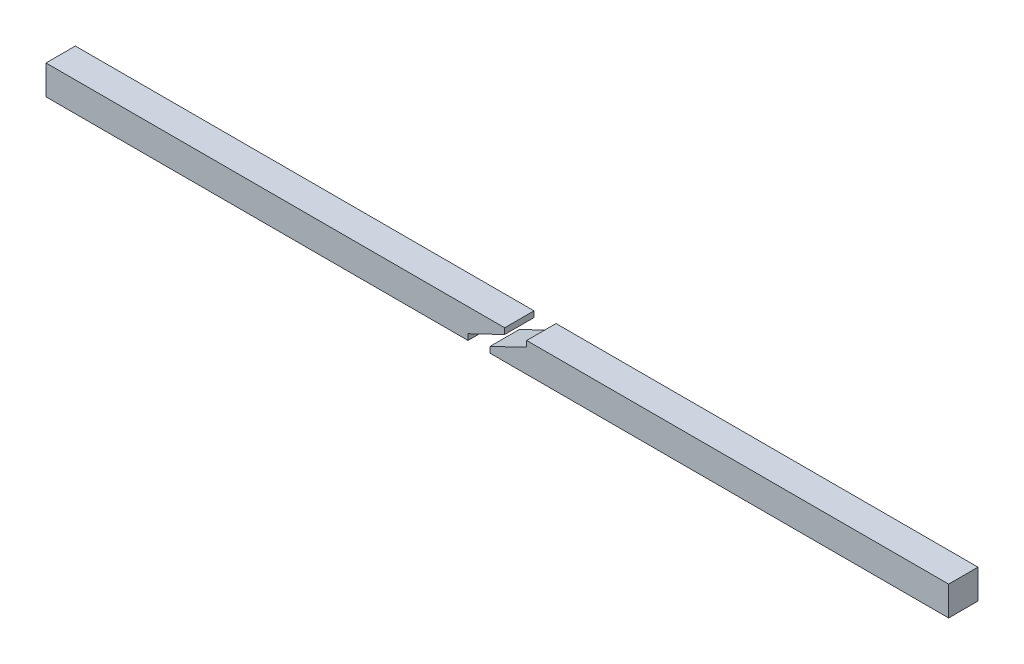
from build123d import *

# Parameters (mm, degrees)
SZKIC11_W                               = 200
SZKIC11_H                               = 200
WI_BA_DACHOWA_MUR_ATA_200_X_200_1_DEPTH = 3125
SZKIC12_W                               = 200
SZKIC12_H                               = 200
WI_BA_DACHOWA_MUR_ATA_200_X_200_2_DEPTH = 3125
WYTNIJ_WYCI_GNI_CIE1_DEPTH              = 3172.784935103
WYTNIJ_WYCI_GNI_CIE2_DEPTH              = 3302.565412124


with BuildPart() as part:
    # Szkic11 → Wi_ba dachowa MUR_ATA 200 X 200_1 (new body)
    with BuildSketch(Plane.YZ):
        Rectangle(SZKIC11_W, SZKIC11_H)
    extrude(amount=WI_BA_DACHOWA_MUR_ATA_200_X_200_1_DEPTH)

    # Szkic2 → Wytnij-wyci_gni_cie1 (cut, through all)
    with BuildSketch(Plane(origin=(2837.132527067, 28.409591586, 100), x_dir=(1, 0, 0), z_dir=(0, 0, 1))):
        Polygon((37.867472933, -128.409591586), (287.867472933, -128.409591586), (287.867472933, 31.590408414), (37.867472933, -88.409591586), align=None)
    extrude(amount=-WYTNIJ_WYCI_GNI_CIE1_DEPTH, mode=Mode.SUBTRACT)


with BuildPart() as body_2:
    # Szkic12 → Wi_ba dachowa MUR_ATA 200 X 200_2 (new body)
    with BuildSketch(Plane.YZ.offset(2875)):
        Rectangle(SZKIC12_W, SZKIC12_H)
    extrude(amount=WI_BA_DACHOWA_MUR_ATA_200_X_200_2_DEPTH)

    # Szkic3 → Wytnij-wyci_gni_cie2 (cut, through all)
    with BuildSketch(Plane(origin=(3293.239734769, -22.091031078, 100), x_dir=(1, 0, 0), z_dir=(0, 0, 1))):
        Polygon((-418.239734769, -37.908968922), (-418.239734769, 122.091031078), (-168.239734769, 122.091031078), (-168.239734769, 82.091031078), align=None)
    extrude(amount=-WYTNIJ_WYCI_GNI_CIE2_DEPTH, mode=Mode.SUBTRACT)


with BuildPart() as part_1:
    # Obiekt-Przenie_Kopiuj1: moved
    add(part.part.moved(Location((-150, 0, 0))))


solid = Compound([body_2.part, part_1.part])
